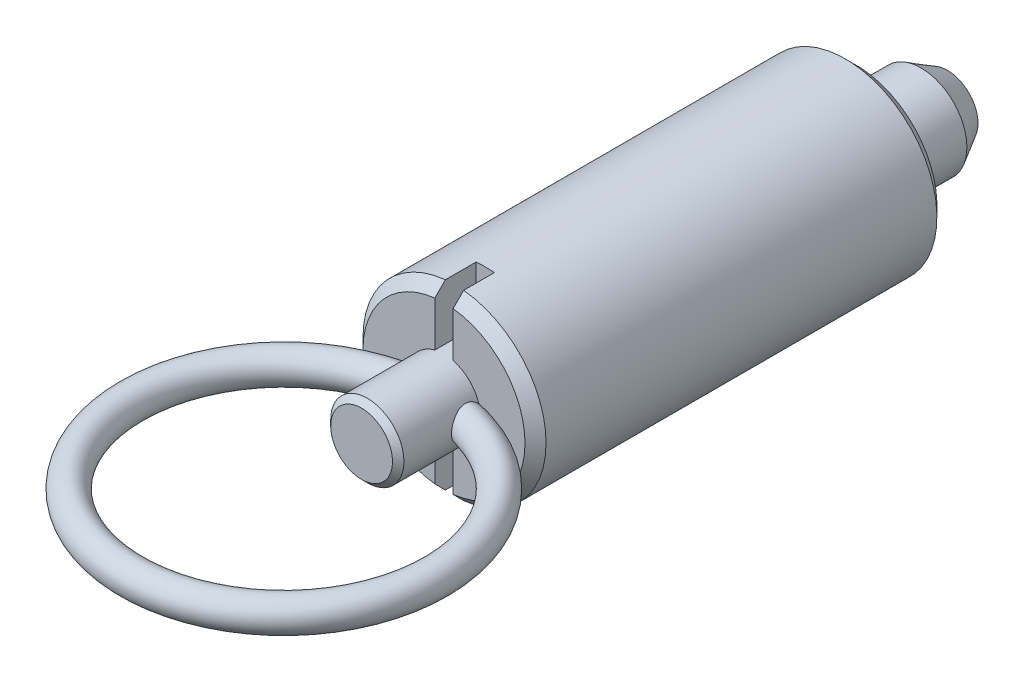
ISO-10303-21;
HEADER;
FILE_DESCRIPTION(('STEP AP214'),'2;1');
FILE_NAME('part.step','',(''),(''),'','','');
FILE_SCHEMA(('AUTOMOTIVE_DESIGN { 1 0 10303 214 1 1 1 1 }'));
ENDSEC;
DATA;
#1=APPLICATION_CONTEXT('core data for automotive mechanical design processes');
#2=APPLICATION_PROTOCOL_DEFINITION('international standard','automotive_design',2000,#1);
#3=PRODUCT_CONTEXT('',#1,'mechanical');
#4=PRODUCT('Part','Part','',(#3));
#5=PRODUCT_RELATED_PRODUCT_CATEGORY('part','',(#4));
#6=PRODUCT_DEFINITION_FORMATION('','',#4);
#7=PRODUCT_DEFINITION_CONTEXT('part definition',#1,'design');
#8=PRODUCT_DEFINITION('design','',#6,#7);
#9=PRODUCT_DEFINITION_SHAPE('','',#8);
#10=(LENGTH_UNIT() NAMED_UNIT(*) SI_UNIT(.MILLI.,.METRE.));
#11=(NAMED_UNIT(*) PLANE_ANGLE_UNIT() SI_UNIT($,.RADIAN.));
#12=(NAMED_UNIT(*) SI_UNIT($,.STERADIAN.) SOLID_ANGLE_UNIT());
#13=UNCERTAINTY_MEASURE_WITH_UNIT(LENGTH_MEASURE(1.E-05),#10,'distance_accuracy_value','');
#14=(GEOMETRIC_REPRESENTATION_CONTEXT(3) GLOBAL_UNCERTAINTY_ASSIGNED_CONTEXT((#13)) GLOBAL_UNIT_ASSIGNED_CONTEXT((#10,
#11,#12)) REPRESENTATION_CONTEXT('',''));
#15=CARTESIAN_POINT('',(0.,0.,0.));
#16=DIRECTION('',(0.,0.,1.));
#17=DIRECTION('',(1.,0.,0.));
#18=AXIS2_PLACEMENT_3D('',#15,#16,#17);
#19=CARTESIAN_POINT('',(2.67209438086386,0.,-8.));
#20=DIRECTION('',(0.,0.,1.));
#21=DIRECTION('',(0.,-1.,0.));
#22=AXIS2_PLACEMENT_3D('',#19,#20,#21);
#23=PLANE('',#22);
#24=CARTESIAN_POINT('',(0.,0.,-8.0000000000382));
#25=DIRECTION('',(0.,0.,1.));
#26=DIRECTION('',(0.,-1.,0.));
#27=AXIS2_PLACEMENT_3D('',#24,#25,#26);
#28=CIRCLE('',#27,2.67209438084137);
#29=CARTESIAN_POINT('',(0.,-2.67209438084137,-8.0000000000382));
#30=VERTEX_POINT('',#29);
#31=EDGE_CURVE('E211',#30,#30,#28,.T.);
#32=ORIENTED_EDGE('',*,*,#31,.F.);
#33=EDGE_LOOP('',(#32));
#34=FACE_BOUND('',#33,.T.);
#35=ADVANCED_FACE('F14',(#34),#23,.F.);
#36=CARTESIAN_POINT('',(0.,0.,-5.69999999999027));
#37=DIRECTION('',(0.,0.,1.));
#38=DIRECTION('',(0.,-1.,0.));
#39=AXIS2_PLACEMENT_3D('',#36,#37,#38);
#40=CONICAL_SURFACE('',#39,4.0000000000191,0.523598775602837);
#41=CARTESIAN_POINT('',(0.,0.,-5.7));
#42=DIRECTION('',(0.,0.,1.));
#43=DIRECTION('',(0.,-1.,0.));
#44=AXIS2_PLACEMENT_3D('',#41,#42,#43);
#45=CIRCLE('',#44,4.);
#46=CARTESIAN_POINT('',(0.,-4.,-5.7));
#47=VERTEX_POINT('',#46);
#48=EDGE_CURVE('E308',#47,#47,#45,.T.);
#49=ORIENTED_EDGE('',*,*,#48,.F.);
#50=EDGE_LOOP('',(#49));
#51=FACE_BOUND('',#50,.T.);
#52=ORIENTED_EDGE('',*,*,#31,.T.);
#53=EDGE_LOOP('',(#52));
#54=FACE_BOUND('',#53,.T.);
#55=ADVANCED_FACE('F189',(#51,#54),#40,.T.);
#56=CARTESIAN_POINT('',(0.,0.,-8.));
#57=DIRECTION('',(0.,0.,1.));
#58=DIRECTION('',(0.,-1.,0.));
#59=AXIS2_PLACEMENT_3D('',#56,#57,#58);
#60=CYLINDRICAL_SURFACE('',#59,4.);
#61=CARTESIAN_POINT('',(0.,0.,0.));
#62=DIRECTION('',(0.,0.,1.));
#63=DIRECTION('',(0.,-1.,0.));
#64=AXIS2_PLACEMENT_3D('',#61,#62,#63);
#65=CIRCLE('',#64,4.);
#66=CARTESIAN_POINT('',(0.,-4.,0.));
#67=VERTEX_POINT('',#66);
#68=EDGE_CURVE('E306',#67,#67,#65,.F.);
#69=ORIENTED_EDGE('',*,*,#68,.T.);
#70=EDGE_LOOP('',(#69));
#71=FACE_BOUND('',#70,.T.);
#72=ORIENTED_EDGE('',*,*,#48,.T.);
#73=EDGE_LOOP('',(#72));
#74=FACE_BOUND('',#73,.T.);
#75=ADVANCED_FACE('F185',(#71,#74),#60,.T.);
#76=CARTESIAN_POINT('',(7.08,0.,0.));
#77=DIRECTION('',(0.,0.,1.));
#78=DIRECTION('',(0.,-1.,0.));
#79=AXIS2_PLACEMENT_3D('',#76,#77,#78);
#80=PLANE('',#79);
#81=CARTESIAN_POINT('',(0.,0.,0.));
#82=DIRECTION('',(0.,0.,1.));
#83=DIRECTION('',(0.,-1.,0.));
#84=AXIS2_PLACEMENT_3D('',#81,#82,#83);
#85=CIRCLE('',#84,7.08);
#86=CARTESIAN_POINT('',(0.,-7.08,0.));
#87=VERTEX_POINT('',#86);
#88=EDGE_CURVE('E24',#87,#87,#85,.T.);
#89=ORIENTED_EDGE('',*,*,#88,.F.);
#90=EDGE_LOOP('',(#89));
#91=FACE_BOUND('',#90,.T.);
#92=ORIENTED_EDGE('',*,*,#68,.F.);
#93=EDGE_LOOP('',(#92));
#94=FACE_BOUND('',#93,.T.);
#95=ADVANCED_FACE('F178',(#91,#94),#80,.F.);
#96=CARTESIAN_POINT('',(0.,0.,0.92));
#97=DIRECTION('',(0.,0.,1.));
#98=DIRECTION('',(0.,-1.,0.));
#99=AXIS2_PLACEMENT_3D('',#96,#97,#98);
#100=CONICAL_SURFACE('',#99,8.,0.785398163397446);
#101=CARTESIAN_POINT('',(0.,0.,0.92));
#102=DIRECTION('',(0.,0.,1.));
#103=DIRECTION('',(0.,-1.,0.));
#104=AXIS2_PLACEMENT_3D('',#101,#102,#103);
#105=CIRCLE('',#104,8.);
#106=CARTESIAN_POINT('',(0.,-8.,0.92));
#107=VERTEX_POINT('',#106);
#108=EDGE_CURVE('E9',#107,#107,#105,.T.);
#109=ORIENTED_EDGE('',*,*,#108,.F.);
#110=EDGE_LOOP('',(#109));
#111=FACE_BOUND('',#110,.T.);
#112=ORIENTED_EDGE('',*,*,#88,.T.);
#113=EDGE_LOOP('',(#112));
#114=FACE_BOUND('',#113,.T.);
#115=ADVANCED_FACE('F169',(#111,#114),#100,.T.);
#116=CARTESIAN_POINT('',(0.,0.,-8.));
#117=DIRECTION('',(0.,0.,1.));
#118=DIRECTION('',(0.,-1.,0.));
#119=AXIS2_PLACEMENT_3D('',#116,#117,#118);
#120=CYLINDRICAL_SURFACE('',#119,8.);
#121=ORIENTED_EDGE('',*,*,#108,.T.);
#122=EDGE_LOOP('',(#121));
#123=FACE_BOUND('',#122,.T.);
#124=DIRECTION('',(0.,0.,1.));
#125=VECTOR('',#124,1.);
#126=CARTESIAN_POINT('',(-0.8,7.95989949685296,-8.));
#127=LINE('',#126,#125);
#128=CARTESIAN_POINT('',(-0.8,7.95989949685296,35.08));
#129=VERTEX_POINT('',#128);
#130=CARTESIAN_POINT('',(-0.8,7.95989949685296,32.4));
#131=VERTEX_POINT('',#130);
#132=EDGE_CURVE('E311',#129,#131,#127,.F.);
#133=ORIENTED_EDGE('',*,*,#132,.T.);
#134=CARTESIAN_POINT('',(0.,0.,32.4));
#135=DIRECTION('',(0.,0.,1.));
#136=DIRECTION('',(0.,-1.,0.));
#137=AXIS2_PLACEMENT_3D('',#134,#135,#136);
#138=CIRCLE('',#137,8.);
#139=CARTESIAN_POINT('',(0.8,7.95989949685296,32.4));
#140=VERTEX_POINT('',#139);
#141=EDGE_CURVE('E33',#140,#131,#138,.T.);
#142=ORIENTED_EDGE('',*,*,#141,.F.);
#143=DIRECTION('',(0.,0.,1.));
#144=VECTOR('',#143,1.);
#145=CARTESIAN_POINT('',(0.8,7.95989949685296,-8.));
#146=LINE('',#145,#144);
#147=CARTESIAN_POINT('',(0.8,7.95989949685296,35.08));
#148=VERTEX_POINT('',#147);
#149=EDGE_CURVE('E287',#140,#148,#146,.T.);
#150=ORIENTED_EDGE('',*,*,#149,.T.);
#151=CARTESIAN_POINT('',(0.,0.,35.08));
#152=DIRECTION('',(0.,0.,1.));
#153=DIRECTION('',(0.,-1.,0.));
#154=AXIS2_PLACEMENT_3D('',#151,#152,#153);
#155=CIRCLE('',#154,8.);
#156=CARTESIAN_POINT('',(0.8,-7.95989949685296,35.08));
#157=VERTEX_POINT('',#156);
#158=EDGE_CURVE('E284',#148,#157,#155,.F.);
#159=ORIENTED_EDGE('',*,*,#158,.T.);
#160=DIRECTION('',(0.,0.,1.));
#161=VECTOR('',#160,1.);
#162=CARTESIAN_POINT('',(0.8,-7.95989949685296,-8.));
#163=LINE('',#162,#161);
#164=CARTESIAN_POINT('',(0.8,-7.95989949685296,32.4));
#165=VERTEX_POINT('',#164);
#166=EDGE_CURVE('E281',#157,#165,#163,.F.);
#167=ORIENTED_EDGE('',*,*,#166,.T.);
#168=CARTESIAN_POINT('',(0.,0.,32.4));
#169=DIRECTION('',(0.,0.,1.));
#170=DIRECTION('',(0.,-1.,0.));
#171=AXIS2_PLACEMENT_3D('',#168,#169,#170);
#172=CIRCLE('',#171,8.);
#173=CARTESIAN_POINT('',(-0.8,-7.95989949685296,32.4));
#174=VERTEX_POINT('',#173);
#175=EDGE_CURVE('E95',#174,#165,#172,.T.);
#176=ORIENTED_EDGE('',*,*,#175,.F.);
#177=DIRECTION('',(0.,0.,1.));
#178=VECTOR('',#177,1.);
#179=CARTESIAN_POINT('',(-0.8,-7.95989949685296,-8.));
#180=LINE('',#179,#178);
#181=CARTESIAN_POINT('',(-0.8,-7.95989949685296,35.08));
#182=VERTEX_POINT('',#181);
#183=EDGE_CURVE('E279',#174,#182,#180,.T.);
#184=ORIENTED_EDGE('',*,*,#183,.T.);
#185=CARTESIAN_POINT('',(0.,0.,35.08));
#186=DIRECTION('',(0.,0.,1.));
#187=DIRECTION('',(0.,-1.,0.));
#188=AXIS2_PLACEMENT_3D('',#185,#186,#187);
#189=CIRCLE('',#188,8.);
#190=EDGE_CURVE('E316',#182,#129,#189,.F.);
#191=ORIENTED_EDGE('',*,*,#190,.T.);
#192=EDGE_LOOP('',(#133,#142,#150,#159,#167,#176,#184,#191));
#193=FACE_BOUND('',#192,.T.);
#194=ADVANCED_FACE('F167',(#123,#193),#120,.T.);
#195=CARTESIAN_POINT('',(0.,0.,43.2));
#196=DIRECTION('',(0.,0.,-1.));
#197=DIRECTION('',(0.,1.,0.));
#198=AXIS2_PLACEMENT_3D('',#195,#196,#197);
#199=PLANE('',#198);
#200=CARTESIAN_POINT('',(0.,0.,43.200000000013));
#201=DIRECTION('',(0.,0.,-1.));
#202=DIRECTION('',(0.,1.,0.));
#203=AXIS2_PLACEMENT_3D('',#200,#201,#202);
#204=CIRCLE('',#203,2.70000000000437);
#205=CARTESIAN_POINT('',(0.,2.70000000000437,43.200000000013));
#206=VERTEX_POINT('',#205);
#207=EDGE_CURVE('E18',#206,#206,#204,.T.);
#208=ORIENTED_EDGE('',*,*,#207,.F.);
#209=EDGE_LOOP('',(#208));
#210=FACE_BOUND('',#209,.T.);
#211=ADVANCED_FACE('F16',(#210),#199,.F.);
#212=CARTESIAN_POINT('',(0.,0.,42.7000000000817));
#213=DIRECTION('',(0.,0.,-1.));
#214=DIRECTION('',(0.,1.,0.));
#215=AXIS2_PLACEMENT_3D('',#212,#213,#214);
#216=CONICAL_SURFACE('',#215,3.1999999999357,0.785398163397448);
#217=ORIENTED_EDGE('',*,*,#207,.T.);
#218=EDGE_LOOP('',(#217));
#219=FACE_BOUND('',#218,.T.);
#220=CARTESIAN_POINT('',(0.,0.,42.7));
#221=DIRECTION('',(0.,0.,1.));
#222=DIRECTION('',(0.,-1.,0.));
#223=AXIS2_PLACEMENT_3D('',#220,#221,#222);
#224=CIRCLE('',#223,3.2);
#225=CARTESIAN_POINT('',(0.,-3.2,42.7));
#226=VERTEX_POINT('',#225);
#227=EDGE_CURVE('E261',#226,#226,#224,.F.);
#228=ORIENTED_EDGE('',*,*,#227,.F.);
#229=EDGE_LOOP('',(#228));
#230=FACE_BOUND('',#229,.T.);
#231=ADVANCED_FACE('F158',(#219,#230),#216,.T.);
#232=CARTESIAN_POINT('',(0.,0.,50.));
#233=DIRECTION('',(0.,-1.,0.));
#234=DIRECTION('',(1.,0.,0.));
#235=AXIS2_PLACEMENT_3D('',#232,#233,#234);
#236=TOROIDAL_SURFACE('',#235,13.3,1.4);
#237=CARTESIAN_POINT('',(3.05618725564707,-0.948535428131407,36.));
#238=CARTESIAN_POINT('',(3.04759612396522,-0.976219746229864,36.0242287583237));
#239=CARTESIAN_POINT('',(3.03891006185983,-1.00287333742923,36.0495771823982));
#240=CARTESIAN_POINT('',(3.02156498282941,-1.05397916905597,36.1024245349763));
#241=CARTESIAN_POINT('',(3.01290597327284,-1.07843085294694,36.1299240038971));
#242=CARTESIAN_POINT('',(2.98728700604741,-1.14829294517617,36.215545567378));
#243=CARTESIAN_POINT('',(2.97070065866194,-1.19016221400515,36.2767487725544));
#244=CARTESIAN_POINT('',(2.94038479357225,-1.26321685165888,36.4060573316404));
#245=CARTESIAN_POINT('',(2.92666198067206,-1.29437725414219,36.4741783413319));
#246=CARTESIAN_POINT('',(2.90378062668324,-1.34492927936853,36.615278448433));
#247=CARTESIAN_POINT('',(2.89461472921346,-1.36433988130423,36.688249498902));
#248=CARTESIAN_POINT('',(2.88214674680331,-1.39047901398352,36.8336037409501));
#249=CARTESIAN_POINT('',(2.87860779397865,-1.39772061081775,36.9058754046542));
#250=CARTESIAN_POINT('',(2.87683702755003,-1.40136047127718,37.050776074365));
#251=CARTESIAN_POINT('',(2.87860876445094,-1.39775148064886,37.1234052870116));
#252=CARTESIAN_POINT('',(2.8870631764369,-1.38020225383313,37.2683154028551));
#253=CARTESIAN_POINT('',(2.89382782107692,-1.36608954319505,37.3405699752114));
#254=CARTESIAN_POINT('',(2.91139074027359,-1.32824478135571,37.481970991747));
#255=CARTESIAN_POINT('',(2.92219002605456,-1.3045103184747,37.5511166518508));
#256=CARTESIAN_POINT('',(2.94831498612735,-1.24444788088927,37.6942866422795));
#257=CARTESIAN_POINT('',(2.96405578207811,-1.20684897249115,37.7677018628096));
#258=CARTESIAN_POINT('',(2.99748458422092,-1.12124820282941,37.907807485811));
#259=CARTESIAN_POINT('',(3.01517509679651,-1.07323287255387,37.9744890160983));
#260=CARTESIAN_POINT('',(3.05284177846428,-0.961273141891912,38.1069865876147));
#261=CARTESIAN_POINT('',(3.07284279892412,-0.896121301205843,38.1717849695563));
#262=CARTESIAN_POINT('',(3.11061394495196,-0.75459454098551,38.2884758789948));
#263=CARTESIAN_POINT('',(3.12838786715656,-0.678239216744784,38.3403905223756));
#264=CARTESIAN_POINT('',(3.15513153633,-0.537433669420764,38.4164101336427));
#265=CARTESIAN_POINT('',(3.16518608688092,-0.475196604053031,38.4442390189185));
#266=CARTESIAN_POINT('',(3.18182284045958,-0.34667790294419,38.4897350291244));
#267=CARTESIAN_POINT('',(3.18840858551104,-0.280400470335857,38.507412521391));
#268=CARTESIAN_POINT('',(3.19742480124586,-0.145195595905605,38.5315158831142));
#269=CARTESIAN_POINT('',(3.19983533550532,-0.0762570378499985,38.5378877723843));
#270=CARTESIAN_POINT('',(3.20014812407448,0.061706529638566,38.5387178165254));
#271=CARTESIAN_POINT('',(3.1980505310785,0.130731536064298,38.5331763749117));
#272=CARTESIAN_POINT('',(3.18991907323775,0.26152850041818,38.5114592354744));
#273=CARTESIAN_POINT('',(3.18418816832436,0.32345907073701,38.4961013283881));
#274=CARTESIAN_POINT('',(3.16963143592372,0.443988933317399,38.4564583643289));
#275=CARTESIAN_POINT('',(3.16080479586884,0.502587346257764,38.4321709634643));
#276=CARTESIAN_POINT('',(3.14003309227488,0.619669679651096,38.3736885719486));
#277=CARTESIAN_POINT('',(3.12790385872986,0.677815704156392,38.3388873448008));
#278=CARTESIAN_POINT('',(3.10188585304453,0.788376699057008,38.2616450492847));
#279=CARTESIAN_POINT('',(3.0879953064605,0.840785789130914,38.2191962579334));
#280=CARTESIAN_POINT('',(3.05685037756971,0.948336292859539,38.1195710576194));
#281=CARTESIAN_POINT('',(3.03944244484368,1.00225298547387,38.0611197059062));
#282=CARTESIAN_POINT('',(3.00512012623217,1.10090258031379,37.9367365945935));
#283=CARTESIAN_POINT('',(2.98820627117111,1.14562589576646,37.8707971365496));
#284=CARTESIAN_POINT('',(2.95418482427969,1.23093169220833,37.722775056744));
#285=CARTESIAN_POINT('',(2.937399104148,1.2699939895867,37.6397345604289));
#286=CARTESIAN_POINT('',(2.90900263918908,1.33376994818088,37.4673634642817));
#287=CARTESIAN_POINT('',(2.89739038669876,1.35848779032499,37.3780347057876));
#288=CARTESIAN_POINT('',(2.88568690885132,1.38306855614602,37.2434882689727));
#289=CARTESIAN_POINT('',(2.88274591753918,1.38917044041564,37.1995899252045));
#290=CARTESIAN_POINT('',(2.8787133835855,1.39750979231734,37.1113524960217));
#291=CARTESIAN_POINT('',(2.87762076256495,1.3997495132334,37.0670136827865));
#292=CARTESIAN_POINT('',(2.87739660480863,1.40021032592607,36.9783688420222));
#293=CARTESIAN_POINT('',(2.87826226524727,1.39843716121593,36.9340628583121));
#294=CARTESIAN_POINT('',(2.88196110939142,1.39079690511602,36.8459048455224));
#295=CARTESIAN_POINT('',(2.88479395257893,1.38493052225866,36.8020527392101));
#296=CARTESIAN_POINT('',(2.89498816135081,1.36355411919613,36.6851446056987));
#297=CARTESIAN_POINT('',(2.9041271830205,1.34417873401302,36.6129028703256));
#298=CARTESIAN_POINT('',(2.92685394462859,1.29393784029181,36.4732402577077));
#299=CARTESIAN_POINT('',(2.94044735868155,1.26305766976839,36.4058256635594));
#300=CARTESIAN_POINT('',(2.97061524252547,1.19037642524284,36.2770777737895));
#301=CARTESIAN_POINT('',(2.98721441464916,1.14848344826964,36.2158019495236));
#302=CARTESIAN_POINT('',(3.01285726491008,1.07856738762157,36.1300799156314));
#303=CARTESIAN_POINT('',(3.02152587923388,1.05409195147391,36.1025460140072));
#304=CARTESIAN_POINT('',(3.03889047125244,1.00293348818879,36.0496345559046));
#305=CARTESIAN_POINT('',(3.0475864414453,0.976251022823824,36.0242564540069));
#306=CARTESIAN_POINT('',(3.05618725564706,0.948535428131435,36.));
#307=B_SPLINE_CURVE_WITH_KNOTS('',3,(#237,#238,#239,#240,#241,#242,#243,#244,#245,#246,#247,
#248,#249,#250,#251,#252,#253,#254,#255,#256,#257,#258,#259,#260,#261,#262,#263,#264,#265,#266,
#267,#268,#269,#270,#271,#272,#273,#274,#275,#276,#277,#278,#279,#280,#281,#282,#283,#284,#285,
#286,#287,#288,#289,#290,#291,#292,#293,#294,#295,#296,#297,#298,#299,#300,#301,#302,#303,#304,
#305,#306),.UNSPECIFIED.,.F.,.F.,(4,2,2,2,2,2,2,2,2,2,2,2,2,2,2,2,2,2,2,2,2,2,2,2,2,2,2,2,2,2,2,
2,2,2,4),(0.,0.113273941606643,0.226576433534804,0.453376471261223,0.680701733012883,
0.907658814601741,1.1247819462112,1.34205026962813,1.56296717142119,1.78393948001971,
2.03486370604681,2.28611434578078,2.56681608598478,2.84703259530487,3.05293332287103,
3.25862339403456,3.46529294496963,3.67195549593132,3.86331580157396,4.05472637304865,
4.26048613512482,4.46645486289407,4.7097330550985,4.95326366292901,5.23181287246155,
5.51028085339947,5.64336214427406,5.77636576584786,5.90917914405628,6.04196953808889,
6.26675287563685,6.49182366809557,6.71883585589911,6.83226624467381,6.94566784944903),.UNSPECIFIED.);
#308=CARTESIAN_POINT('',(3.05618725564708,-0.948535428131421,36.));
#309=VERTEX_POINT('',#308);
#310=CARTESIAN_POINT('',(3.05618725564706,0.948535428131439,36.));
#311=VERTEX_POINT('',#310);
#312=EDGE_CURVE('E93',#309,#311,#307,.T.);
#313=ORIENTED_EDGE('',*,*,#312,.F.);
#314=CARTESIAN_POINT('',(3.05618725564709,-0.948535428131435,36.));
#315=CARTESIAN_POINT('',(3.11757531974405,-0.934303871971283,36.));
#316=CARTESIAN_POINT('',(3.1787658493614,-0.919154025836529,36.));
#317=CARTESIAN_POINT('',(3.30064120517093,-0.886604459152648,36.));
#318=CARTESIAN_POINT('',(3.36132513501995,-0.869201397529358,36.));
#319=CARTESIAN_POINT('',(3.48280168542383,-0.831489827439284,36.));
#320=CARTESIAN_POINT('',(3.54358210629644,-0.811141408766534,35.9999999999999));
#321=CARTESIAN_POINT('',(3.66391929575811,-0.767183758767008,36.0000000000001));
#322=CARTESIAN_POINT('',(3.72347671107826,-0.743576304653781,36.0000000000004));
#323=CARTESIAN_POINT('',(3.84948729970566,-0.688571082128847,36.0000000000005));
#324=CARTESIAN_POINT('',(3.91567340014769,-0.6565387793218,36.0000000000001));
#325=CARTESIAN_POINT('',(4.01198947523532,-0.603316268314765,36.));
#326=CARTESIAN_POINT('',(4.04356327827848,-0.584739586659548,36.));
#327=CARTESIAN_POINT('',(4.10542236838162,-0.545563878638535,36.));
#328=CARTESIAN_POINT('',(4.13570822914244,-0.524965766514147,36.));
#329=CARTESIAN_POINT('',(4.20107407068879,-0.476575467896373,36.));
#330=CARTESIAN_POINT('',(4.23572982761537,-0.448200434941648,36.));
#331=CARTESIAN_POINT('',(4.30114070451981,-0.387170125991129,36.));
#332=CARTESIAN_POINT('',(4.33189858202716,-0.354517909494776,36.));
#333=CARTESIAN_POINT('',(4.37886544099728,-0.294918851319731,36.));
#334=CARTESIAN_POINT('',(4.39666034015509,-0.269236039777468,36.));
#335=CARTESIAN_POINT('',(4.42807946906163,-0.215481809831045,36.));
#336=CARTESIAN_POINT('',(4.44171797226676,-0.187418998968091,36.));
#337=CARTESIAN_POINT('',(4.46148654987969,-0.134775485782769,36.));
#338=CARTESIAN_POINT('',(4.46855216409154,-0.110550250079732,36.));
#339=CARTESIAN_POINT('',(4.47850333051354,-0.061256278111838,36.));
#340=CARTESIAN_POINT('',(4.48139284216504,-0.0361883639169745,36.));
#341=CARTESIAN_POINT('',(4.48269592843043,0.0141225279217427,36.));
#342=CARTESIAN_POINT('',(4.48109955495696,0.0393657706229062,36.));
#343=CARTESIAN_POINT('',(4.47358395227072,0.0892015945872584,36.));
#344=CARTESIAN_POINT('',(4.46766114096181,0.113793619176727,36.));
#345=CARTESIAN_POINT('',(4.45018950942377,0.167425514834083,36.));
#346=CARTESIAN_POINT('',(4.43763875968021,0.196135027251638,36.));
#347=CARTESIAN_POINT('',(4.40807259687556,0.25119605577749,36.));
#348=CARTESIAN_POINT('',(4.39104303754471,0.27753973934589,36.));
#349=CARTESIAN_POINT('',(4.35747735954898,0.322732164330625,36.));
#350=CARTESIAN_POINT('',(4.3415256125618,0.342025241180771,36.));
#351=CARTESIAN_POINT('',(4.30803028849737,0.379112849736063,36.));
#352=CARTESIAN_POINT('',(4.29048901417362,0.396909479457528,36.));
#353=CARTESIAN_POINT('',(4.23589297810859,0.448390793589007,36.));
#354=CARTESIAN_POINT('',(4.19694549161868,0.480066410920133,36.));
#355=CARTESIAN_POINT('',(4.11494332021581,0.539787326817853,36.));
#356=CARTESIAN_POINT('',(4.07180962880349,0.567720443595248,36.));
#357=CARTESIAN_POINT('',(3.98335508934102,0.619930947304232,36.));
#358=CARTESIAN_POINT('',(3.93803224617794,0.644204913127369,36.));
#359=CARTESIAN_POINT('',(3.84575758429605,0.68981589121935,36.));
#360=CARTESIAN_POINT('',(3.79880068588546,0.711142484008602,36.));
#361=CARTESIAN_POINT('',(3.70382084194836,0.751278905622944,36.));
#362=CARTESIAN_POINT('',(3.65579766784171,0.770088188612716,36.));
#363=CARTESIAN_POINT('',(3.56213969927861,0.804416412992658,36.));
#364=CARTESIAN_POINT('',(3.51655381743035,0.820070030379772,36.));
#365=CARTESIAN_POINT('',(3.42485591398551,0.8497685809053,36.));
#366=CARTESIAN_POINT('',(3.37874381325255,0.863813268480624,36.));
#367=CARTESIAN_POINT('',(3.2867198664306,0.890321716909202,36.));
#368=CARTESIAN_POINT('',(3.24081322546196,0.902803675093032,36.));
#369=CARTESIAN_POINT('',(3.1487061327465,0.926545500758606,36.));
#370=CARTESIAN_POINT('',(3.10250582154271,0.937805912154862,36.));
#371=CARTESIAN_POINT('',(3.05618725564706,0.948535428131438,36.));
#372=B_SPLINE_CURVE_WITH_KNOTS('',3,(#314,#315,#316,#317,#318,#319,#320,#321,#322,#323,#324,
#325,#326,#327,#328,#329,#330,#331,#332,#333,#334,#335,#336,#337,#338,#339,#340,#341,#342,#343,
#344,#345,#346,#347,#348,#349,#350,#351,#352,#353,#354,#355,#356,#357,#358,#359,#360,#361,#362,
#363,#364,#365,#366,#367,#368,#369,#370,#371),.UNSPECIFIED.,.F.,.F.,(4,2,2,2,2,2,2,2,2,2,2,2,2,
2,2,2,2,2,2,2,2,2,2,2,2,2,2,2,4),(0.,0.189063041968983,0.378409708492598,0.570615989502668,
0.762717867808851,0.982945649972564,1.0927846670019,1.20257423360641,1.33668510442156,
1.47070056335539,1.56415704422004,1.65728887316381,1.73267389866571,1.80798740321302,
1.88346805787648,1.95901127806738,2.05249160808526,2.1462708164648,2.22126633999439,
2.29615490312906,2.44631220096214,2.60027018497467,2.75437123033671,2.9090038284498,
3.06366990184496,3.20823235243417,3.35281683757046,3.4955194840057,3.63815832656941),.UNSPECIFIED.);
#373=EDGE_CURVE('E87',#309,#311,#372,.T.);
#374=ORIENTED_EDGE('',*,*,#373,.T.);
#375=EDGE_LOOP('',(#313,#374));
#376=FACE_BOUND('',#375,.T.);
#377=CARTESIAN_POINT('',(-3.05618725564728,0.948535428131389,36.));
#378=CARTESIAN_POINT('',(-3.11757531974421,0.93430387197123,36.));
#379=CARTESIAN_POINT('',(-3.17876584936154,0.919154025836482,36.));
#380=CARTESIAN_POINT('',(-3.30064120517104,0.886604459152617,36.));
#381=CARTESIAN_POINT('',(-3.36132513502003,0.869201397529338,36.));
#382=CARTESIAN_POINT('',(-3.48280168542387,0.831489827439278,36.));
#383=CARTESIAN_POINT('',(-3.54358210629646,0.81114140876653,35.9999999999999));
#384=CARTESIAN_POINT('',(-3.66391929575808,0.767183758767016,36.0000000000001));
#385=CARTESIAN_POINT('',(-3.72347671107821,0.743576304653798,36.0000000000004));
#386=CARTESIAN_POINT('',(-3.84948729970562,0.688571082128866,36.0000000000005));
#387=CARTESIAN_POINT('',(-3.91567340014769,0.65653877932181,36.0000000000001));
#388=CARTESIAN_POINT('',(-4.01198947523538,0.603316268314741,36.));
#389=CARTESIAN_POINT('',(-4.04356327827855,0.584739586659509,36.));
#390=CARTESIAN_POINT('',(-4.10542236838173,0.545563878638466,36.));
#391=CARTESIAN_POINT('',(-4.13570822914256,0.524965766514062,36.));
#392=CARTESIAN_POINT('',(-4.20107407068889,0.47657546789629,36.));
#393=CARTESIAN_POINT('',(-4.23572982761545,0.448200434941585,36.));
#394=CARTESIAN_POINT('',(-4.30114070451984,0.387170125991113,36.));
#395=CARTESIAN_POINT('',(-4.33189858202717,0.354517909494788,36.));
#396=CARTESIAN_POINT('',(-4.37886544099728,0.294918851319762,36.));
#397=CARTESIAN_POINT('',(-4.39666034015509,0.269236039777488,36.));
#398=CARTESIAN_POINT('',(-4.42807946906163,0.215481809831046,36.));
#399=CARTESIAN_POINT('',(-4.44171797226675,0.187418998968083,36.));
#400=CARTESIAN_POINT('',(-4.46148654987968,0.134775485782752,36.));
#401=CARTESIAN_POINT('',(-4.46855216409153,0.110550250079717,36.));
#402=CARTESIAN_POINT('',(-4.47850333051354,0.061256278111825,36.));
#403=CARTESIAN_POINT('',(-4.48139284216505,0.0361883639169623,36.));
#404=CARTESIAN_POINT('',(-4.48269592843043,-0.0141225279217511,36.));
#405=CARTESIAN_POINT('',(-4.48109955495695,-0.0393657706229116,36.));
#406=CARTESIAN_POINT('',(-4.47358395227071,-0.089201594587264,36.));
#407=CARTESIAN_POINT('',(-4.46766114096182,-0.113793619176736,36.));
#408=CARTESIAN_POINT('',(-4.45018950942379,-0.167425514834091,36.));
#409=CARTESIAN_POINT('',(-4.43763875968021,-0.196135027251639,36.));
#410=CARTESIAN_POINT('',(-4.40807259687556,-0.251196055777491,36.));
#411=CARTESIAN_POINT('',(-4.39104303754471,-0.277539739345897,36.));
#412=CARTESIAN_POINT('',(-4.35747735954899,-0.322732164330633,36.));
#413=CARTESIAN_POINT('',(-4.3415256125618,-0.342025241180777,36.));
#414=CARTESIAN_POINT('',(-4.30803028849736,-0.379112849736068,36.));
#415=CARTESIAN_POINT('',(-4.29048901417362,-0.396909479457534,36.));
#416=CARTESIAN_POINT('',(-4.23589297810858,-0.448390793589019,36.));
#417=CARTESIAN_POINT('',(-4.19694549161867,-0.480066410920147,36.));
#418=CARTESIAN_POINT('',(-4.1149433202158,-0.539787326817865,36.));
#419=CARTESIAN_POINT('',(-4.07180962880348,-0.567720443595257,36.));
#420=CARTESIAN_POINT('',(-3.98335508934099,-0.619930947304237,36.));
#421=CARTESIAN_POINT('',(-3.93803224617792,-0.644204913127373,36.));
#422=CARTESIAN_POINT('',(-3.84575758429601,-0.689815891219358,36.));
#423=CARTESIAN_POINT('',(-3.79880068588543,-0.711142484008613,36.));
#424=CARTESIAN_POINT('',(-3.70382084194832,-0.751278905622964,36.));
#425=CARTESIAN_POINT('',(-3.65579766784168,-0.770088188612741,36.));
#426=CARTESIAN_POINT('',(-3.56213969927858,-0.804416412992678,36.));
#427=CARTESIAN_POINT('',(-3.51655381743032,-0.820070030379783,36.));
#428=CARTESIAN_POINT('',(-3.42485591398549,-0.849768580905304,36.));
#429=CARTESIAN_POINT('',(-3.37874381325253,-0.863813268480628,36.));
#430=CARTESIAN_POINT('',(-3.28671986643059,-0.890321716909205,36.));
#431=CARTESIAN_POINT('',(-3.24081322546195,-0.902803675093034,36.));
#432=CARTESIAN_POINT('',(-3.1487061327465,-0.926545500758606,36.));
#433=CARTESIAN_POINT('',(-3.10250582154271,-0.937805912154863,36.));
#434=CARTESIAN_POINT('',(-3.05618725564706,-0.948535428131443,36.));
#435=B_SPLINE_CURVE_WITH_KNOTS('',3,(#377,#378,#379,#380,#381,#382,#383,#384,#385,#386,#387,
#388,#389,#390,#391,#392,#393,#394,#395,#396,#397,#398,#399,#400,#401,#402,#403,#404,#405,#406,
#407,#408,#409,#410,#411,#412,#413,#414,#415,#416,#417,#418,#419,#420,#421,#422,#423,#424,#425,
#426,#427,#428,#429,#430,#431,#432,#433,#434),.UNSPECIFIED.,.F.,.F.,(4,2,2,2,2,2,2,2,2,2,2,2,2,
2,2,2,2,2,2,2,2,2,2,2,2,2,2,2,4),(0.,0.189063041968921,0.378409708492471,0.570615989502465,
0.762717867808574,0.982945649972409,1.09278466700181,1.20257423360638,1.33668510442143,
1.47070056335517,1.56415704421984,1.65728887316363,1.73267389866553,1.80798740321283,
1.88346805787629,1.95901127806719,2.05249160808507,2.14627081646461,2.22126633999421,
2.29615490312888,2.44631220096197,2.6002701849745,2.75437123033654,2.90900382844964,
3.06366990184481,3.20823235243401,3.35281683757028,3.49551948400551,3.63815832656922),.UNSPECIFIED.);
#436=CARTESIAN_POINT('',(-3.05618725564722,0.94853542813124,36.));
#437=VERTEX_POINT('',#436);
#438=CARTESIAN_POINT('',(-3.05618725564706,-0.948535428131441,36.));
#439=VERTEX_POINT('',#438);
#440=EDGE_CURVE('E111',#437,#439,#435,.T.);
#441=ORIENTED_EDGE('',*,*,#440,.T.);
#442=CARTESIAN_POINT('',(-3.05618725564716,0.948535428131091,36.));
#443=CARTESIAN_POINT('',(-3.04759612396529,0.976219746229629,36.0242287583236));
#444=CARTESIAN_POINT('',(-3.03891006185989,1.00287333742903,36.049577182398));
#445=CARTESIAN_POINT('',(-3.02156498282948,1.05397916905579,36.1024245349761));
#446=CARTESIAN_POINT('',(-3.01290597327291,1.07843085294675,36.1299240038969));
#447=CARTESIAN_POINT('',(-2.98728700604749,1.14829294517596,36.2155455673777));
#448=CARTESIAN_POINT('',(-2.97070065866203,1.19016221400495,36.2767487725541));
#449=CARTESIAN_POINT('',(-2.94038479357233,1.26321685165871,36.40605733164));
#450=CARTESIAN_POINT('',(-2.92666198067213,1.29437725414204,36.4741783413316));
#451=CARTESIAN_POINT('',(-2.90378062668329,1.34492927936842,36.6152784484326));
#452=CARTESIAN_POINT('',(-2.8946147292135,1.36433988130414,36.6882494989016));
#453=CARTESIAN_POINT('',(-2.88214674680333,1.39047901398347,36.8336037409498));
#454=CARTESIAN_POINT('',(-2.87860779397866,1.39772061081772,36.9058754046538));
#455=CARTESIAN_POINT('',(-2.87683702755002,1.40136047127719,37.0507760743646));
#456=CARTESIAN_POINT('',(-2.87860876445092,1.39775148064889,37.1234052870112));
#457=CARTESIAN_POINT('',(-2.88706317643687,1.38020225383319,37.2683154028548));
#458=CARTESIAN_POINT('',(-2.89382782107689,1.36608954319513,37.3405699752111));
#459=CARTESIAN_POINT('',(-2.91139074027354,1.32824478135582,37.4819709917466));
#460=CARTESIAN_POINT('',(-2.92219002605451,1.30451031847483,37.5511166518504));
#461=CARTESIAN_POINT('',(-2.94831498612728,1.24444788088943,37.6942866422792));
#462=CARTESIAN_POINT('',(-2.96405578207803,1.20684897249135,37.7677018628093));
#463=CARTESIAN_POINT('',(-2.99748458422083,1.12124820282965,37.9078074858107));
#464=CARTESIAN_POINT('',(-3.01517509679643,1.07323287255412,37.9744890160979));
#465=CARTESIAN_POINT('',(-3.05284177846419,0.96127314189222,38.1069865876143));
#466=CARTESIAN_POINT('',(-3.07284279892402,0.89612130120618,38.171784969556));
#467=CARTESIAN_POINT('',(-3.11061394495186,0.75459454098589,38.2884758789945));
#468=CARTESIAN_POINT('',(-3.12838786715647,0.678239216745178,38.3403905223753));
#469=CARTESIAN_POINT('',(-3.15513153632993,0.537433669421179,38.4164101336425));
#470=CARTESIAN_POINT('',(-3.16518608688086,0.475196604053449,38.4442390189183));
#471=CARTESIAN_POINT('',(-3.18182284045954,0.346677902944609,38.4897350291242));
#472=CARTESIAN_POINT('',(-3.188408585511,0.280400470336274,38.5074125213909));
#473=CARTESIAN_POINT('',(-3.19742480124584,0.145195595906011,38.5315158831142));
#474=CARTESIAN_POINT('',(-3.19983533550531,0.0762570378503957,38.5378877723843));
#475=CARTESIAN_POINT('',(-3.20014812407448,-0.0617065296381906,38.5387178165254));
#476=CARTESIAN_POINT('',(-3.19805053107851,-0.130731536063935,38.5331763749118));
#477=CARTESIAN_POINT('',(-3.18991907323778,-0.261528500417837,38.5114592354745));
#478=CARTESIAN_POINT('',(-3.18418816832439,-0.323459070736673,38.4961013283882));
#479=CARTESIAN_POINT('',(-3.16963143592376,-0.443988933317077,38.456458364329));
#480=CARTESIAN_POINT('',(-3.16080479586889,-0.502587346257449,38.4321709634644));
#481=CARTESIAN_POINT('',(-3.14003309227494,-0.619669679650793,38.3736885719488));
#482=CARTESIAN_POINT('',(-3.12790385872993,-0.677815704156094,38.338887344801));
#483=CARTESIAN_POINT('',(-3.10188585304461,-0.788376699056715,38.2616450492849));
#484=CARTESIAN_POINT('',(-3.08799530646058,-0.840785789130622,38.2191962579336));
#485=CARTESIAN_POINT('',(-3.0568503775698,-0.948336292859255,38.1195710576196));
#486=CARTESIAN_POINT('',(-3.03944244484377,-1.0022529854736,38.0611197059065));
#487=CARTESIAN_POINT('',(-3.00512012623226,-1.10090258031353,37.9367365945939));
#488=CARTESIAN_POINT('',(-2.98820627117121,-1.14562589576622,37.87079713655));
#489=CARTESIAN_POINT('',(-2.95418482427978,-1.23093169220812,37.7227750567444));
#490=CARTESIAN_POINT('',(-2.93739910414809,-1.2699939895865,37.6397345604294));
#491=CARTESIAN_POINT('',(-2.90900263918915,-1.33376994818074,37.4673634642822));
#492=CARTESIAN_POINT('',(-2.89739038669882,-1.35848779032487,37.3780347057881));
#493=CARTESIAN_POINT('',(-2.88568690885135,-1.38306855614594,37.2434882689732));
#494=CARTESIAN_POINT('',(-2.88274591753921,-1.38917044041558,37.199589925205));
#495=CARTESIAN_POINT('',(-2.87871338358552,-1.39750979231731,37.1113524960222));
#496=CARTESIAN_POINT('',(-2.87762076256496,-1.39974951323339,37.067013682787));
#497=CARTESIAN_POINT('',(-2.87739660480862,-1.40021032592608,36.9783688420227));
#498=CARTESIAN_POINT('',(-2.87826226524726,-1.39843716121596,36.9340628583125));
#499=CARTESIAN_POINT('',(-2.88196110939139,-1.39079690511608,36.8459048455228));
#500=CARTESIAN_POINT('',(-2.8847939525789,-1.38493052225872,36.8020527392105));
#501=CARTESIAN_POINT('',(-2.89498816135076,-1.36355411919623,36.6851446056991));
#502=CARTESIAN_POINT('',(-2.90412718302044,-1.34417873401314,36.612902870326));
#503=CARTESIAN_POINT('',(-2.92685394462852,-1.29393784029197,36.4732402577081));
#504=CARTESIAN_POINT('',(-2.94044735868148,-1.26305766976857,36.4058256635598));
#505=CARTESIAN_POINT('',(-2.9706152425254,-1.19037642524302,36.2770777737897));
#506=CARTESIAN_POINT('',(-2.9872144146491,-1.14848344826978,36.2158019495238));
#507=CARTESIAN_POINT('',(-3.01285726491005,-1.07856738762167,36.1300799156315));
#508=CARTESIAN_POINT('',(-3.02152587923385,-1.05409195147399,36.1025460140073));
#509=CARTESIAN_POINT('',(-3.03889047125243,-1.00293348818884,36.0496345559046));
#510=CARTESIAN_POINT('',(-3.04758644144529,-0.976251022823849,36.0242564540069));
#511=CARTESIAN_POINT('',(-3.05618725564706,-0.948535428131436,36.));
#512=B_SPLINE_CURVE_WITH_KNOTS('',3,(#442,#443,#444,#445,#446,#447,#448,#449,#450,#451,#452,
#453,#454,#455,#456,#457,#458,#459,#460,#461,#462,#463,#464,#465,#466,#467,#468,#469,#470,#471,
#472,#473,#474,#475,#476,#477,#478,#479,#480,#481,#482,#483,#484,#485,#486,#487,#488,#489,#490,
#491,#492,#493,#494,#495,#496,#497,#498,#499,#500,#501,#502,#503,#504,#505,#506,#507,#508,#509,
#510,#511),.UNSPECIFIED.,.F.,.F.,(4,2,2,2,2,2,2,2,2,2,2,2,2,2,2,2,2,2,2,2,2,2,2,2,2,2,2,2,2,2,2,
2,2,2,4),(0.,0.113273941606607,0.226576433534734,0.453376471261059,0.680701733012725,
0.907658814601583,1.12478194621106,1.34205026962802,1.56296717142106,1.78393948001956,
2.03486370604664,2.28611434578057,2.56681608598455,2.84703259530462,3.05293332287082,
3.25862339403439,3.46529294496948,3.67195549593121,3.86331580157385,4.05472637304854,
4.2604861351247,4.46645486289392,4.7097330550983,4.95326366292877,5.23181287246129,
5.5102808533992,5.6433621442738,5.77636576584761,5.90917914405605,6.04196953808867,
6.26675287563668,6.49182366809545,6.71883585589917,6.83226624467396,6.94566784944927),.UNSPECIFIED.);
#513=EDGE_CURVE('E135',#437,#439,#512,.T.);
#514=ORIENTED_EDGE('',*,*,#513,.F.);
#515=EDGE_LOOP('',(#441,#514));
#516=FACE_BOUND('',#515,.T.);
#517=ADVANCED_FACE('F90',(#376,#516),#236,.T.);
#518=CARTESIAN_POINT('',(0.,0.,36.));
#519=DIRECTION('',(0.,0.,-1.));
#520=DIRECTION('',(0.,1.,0.));
#521=AXIS2_PLACEMENT_3D('',#518,#519,#520);
#522=PLANE('',#521);
#523=ORIENTED_EDGE('',*,*,#373,.F.);
#524=CARTESIAN_POINT('',(0.,0.,36.));
#525=DIRECTION('',(0.,0.,1.));
#526=DIRECTION('',(0.,-1.,0.));
#527=AXIS2_PLACEMENT_3D('',#524,#525,#526);
#528=CIRCLE('',#527,3.2);
#529=CARTESIAN_POINT('',(0.8,-3.09838667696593,36.));
#530=VERTEX_POINT('',#529);
#531=EDGE_CURVE('E109',#530,#309,#528,.T.);
#532=ORIENTED_EDGE('',*,*,#531,.F.);
#533=DIRECTION('',(0.,-1.,0.));
#534=VECTOR('',#533,1.);
#535=CARTESIAN_POINT('',(0.8,-16.,36.));
#536=LINE('',#535,#534);
#537=CARTESIAN_POINT('',(0.8,-7.03465706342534,36.));
#538=VERTEX_POINT('',#537);
#539=EDGE_CURVE('E288',#538,#530,#536,.F.);
#540=ORIENTED_EDGE('',*,*,#539,.F.);
#541=CARTESIAN_POINT('',(0.,0.,36.));
#542=DIRECTION('',(0.,0.,-1.));
#543=DIRECTION('',(0.,1.,0.));
#544=AXIS2_PLACEMENT_3D('',#541,#542,#543);
#545=CIRCLE('',#544,7.08);
#546=CARTESIAN_POINT('',(0.8,7.03465706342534,36.));
#547=VERTEX_POINT('',#546);
#548=EDGE_CURVE('E257',#547,#538,#545,.T.);
#549=ORIENTED_EDGE('',*,*,#548,.F.);
#550=DIRECTION('',(0.,-1.,0.));
#551=VECTOR('',#550,1.);
#552=CARTESIAN_POINT('',(0.8,-16.,36.));
#553=LINE('',#552,#551);
#554=CARTESIAN_POINT('',(0.8,3.09838667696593,36.));
#555=VERTEX_POINT('',#554);
#556=EDGE_CURVE('E101',#555,#547,#553,.F.);
#557=ORIENTED_EDGE('',*,*,#556,.F.);
#558=CARTESIAN_POINT('',(0.,0.,36.));
#559=DIRECTION('',(0.,0.,1.));
#560=DIRECTION('',(0.,-1.,0.));
#561=AXIS2_PLACEMENT_3D('',#558,#559,#560);
#562=CIRCLE('',#561,3.2);
#563=EDGE_CURVE('E97',#311,#555,#562,.T.);
#564=ORIENTED_EDGE('',*,*,#563,.F.);
#565=EDGE_LOOP('',(#523,#532,#540,#549,#557,#564));
#566=FACE_BOUND('',#565,.T.);
#567=ADVANCED_FACE('F98',(#566),#522,.F.);
#568=CARTESIAN_POINT('',(0.,0.,28.8));
#569=DIRECTION('',(0.,0.,1.));
#570=DIRECTION('',(0.,-1.,0.));
#571=AXIS2_PLACEMENT_3D('',#568,#569,#570);
#572=CYLINDRICAL_SURFACE('',#571,3.2);
#573=ORIENTED_EDGE('',*,*,#227,.T.);
#574=EDGE_LOOP('',(#573));
#575=FACE_BOUND('',#574,.T.);
#576=CARTESIAN_POINT('',(0.,0.,32.4));
#577=DIRECTION('',(0.,0.,1.));
#578=DIRECTION('',(0.,-1.,0.));
#579=AXIS2_PLACEMENT_3D('',#576,#577,#578);
#580=CIRCLE('',#579,3.2);
#581=CARTESIAN_POINT('',(-0.8,-3.09838667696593,32.4));
#582=VERTEX_POINT('',#581);
#583=CARTESIAN_POINT('',(0.8,-3.09838667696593,32.4));
#584=VERTEX_POINT('',#583);
#585=EDGE_CURVE('E262',#582,#584,#580,.T.);
#586=ORIENTED_EDGE('',*,*,#585,.T.);
#587=DIRECTION('',(0.,0.,1.));
#588=VECTOR('',#587,1.);
#589=CARTESIAN_POINT('',(0.8,-3.09838667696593,32.4));
#590=LINE('',#589,#588);
#591=EDGE_CURVE('E291',#530,#584,#590,.F.);
#592=ORIENTED_EDGE('',*,*,#591,.F.);
#593=ORIENTED_EDGE('',*,*,#531,.T.);
#594=ORIENTED_EDGE('',*,*,#312,.T.);
#595=ORIENTED_EDGE('',*,*,#563,.T.);
#596=DIRECTION('',(0.,0.,1.));
#597=VECTOR('',#596,1.);
#598=CARTESIAN_POINT('',(0.8,3.09838667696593,32.4));
#599=LINE('',#598,#597);
#600=CARTESIAN_POINT('',(0.8,3.09838667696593,32.4));
#601=VERTEX_POINT('',#600);
#602=EDGE_CURVE('E298',#601,#555,#599,.T.);
#603=ORIENTED_EDGE('',*,*,#602,.F.);
#604=CARTESIAN_POINT('',(0.,0.,32.4));
#605=DIRECTION('',(0.,0.,1.));
#606=DIRECTION('',(0.,-1.,0.));
#607=AXIS2_PLACEMENT_3D('',#604,#605,#606);
#608=CIRCLE('',#607,3.2);
#609=CARTESIAN_POINT('',(-0.8,3.09838667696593,32.4));
#610=VERTEX_POINT('',#609);
#611=EDGE_CURVE('E260',#610,#601,#608,.F.);
#612=ORIENTED_EDGE('',*,*,#611,.F.);
#613=DIRECTION('',(0.,0.,1.));
#614=VECTOR('',#613,1.);
#615=CARTESIAN_POINT('',(-0.8,3.09838667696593,36.001));
#616=LINE('',#615,#614);
#617=CARTESIAN_POINT('',(-0.8,3.09838667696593,36.));
#618=VERTEX_POINT('',#617);
#619=EDGE_CURVE('E148',#618,#610,#616,.F.);
#620=ORIENTED_EDGE('',*,*,#619,.F.);
#621=CARTESIAN_POINT('',(0.,0.,36.));
#622=DIRECTION('',(0.,0.,1.));
#623=DIRECTION('',(0.,-1.,0.));
#624=AXIS2_PLACEMENT_3D('',#621,#622,#623);
#625=CIRCLE('',#624,3.2);
#626=EDGE_CURVE('E105',#618,#437,#625,.T.);
#627=ORIENTED_EDGE('',*,*,#626,.T.);
#628=ORIENTED_EDGE('',*,*,#513,.T.);
#629=CARTESIAN_POINT('',(0.,0.,36.));
#630=DIRECTION('',(0.,0.,1.));
#631=DIRECTION('',(0.,-1.,0.));
#632=AXIS2_PLACEMENT_3D('',#629,#630,#631);
#633=CIRCLE('',#632,3.2);
#634=CARTESIAN_POINT('',(-0.8,-3.09838667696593,36.));
#635=VERTEX_POINT('',#634);
#636=EDGE_CURVE('E142',#439,#635,#633,.T.);
#637=ORIENTED_EDGE('',*,*,#636,.T.);
#638=DIRECTION('',(0.,0.,1.));
#639=VECTOR('',#638,1.);
#640=CARTESIAN_POINT('',(-0.8,-3.09838667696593,36.001));
#641=LINE('',#640,#639);
#642=EDGE_CURVE('E268',#582,#635,#641,.T.);
#643=ORIENTED_EDGE('',*,*,#642,.F.);
#644=EDGE_LOOP('',(#586,#592,#593,#594,#595,#603,#612,#620,#627,#628,#637,#643));
#645=FACE_BOUND('',#644,.T.);
#646=ADVANCED_FACE('F107',(#575,#645),#572,.T.);
#647=CARTESIAN_POINT('',(0.,0.,36.));
#648=DIRECTION('',(0.,0.,-1.));
#649=DIRECTION('',(0.,1.,0.));
#650=AXIS2_PLACEMENT_3D('',#647,#648,#649);
#651=PLANE('',#650);
#652=ORIENTED_EDGE('',*,*,#440,.F.);
#653=ORIENTED_EDGE('',*,*,#626,.F.);
#654=DIRECTION('',(0.,1.,0.));
#655=VECTOR('',#654,1.);
#656=CARTESIAN_POINT('',(-0.8,-16.,36.));
#657=LINE('',#656,#655);
#658=CARTESIAN_POINT('',(-0.8,7.03465706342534,36.));
#659=VERTEX_POINT('',#658);
#660=EDGE_CURVE('E153',#659,#618,#657,.F.);
#661=ORIENTED_EDGE('',*,*,#660,.F.);
#662=CARTESIAN_POINT('',(0.,0.,36.));
#663=DIRECTION('',(0.,0.,-1.));
#664=DIRECTION('',(0.,1.,0.));
#665=AXIS2_PLACEMENT_3D('',#662,#663,#664);
#666=CIRCLE('',#665,7.08);
#667=CARTESIAN_POINT('',(-0.8,-7.03465706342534,36.));
#668=VERTEX_POINT('',#667);
#669=EDGE_CURVE('E214',#668,#659,#666,.T.);
#670=ORIENTED_EDGE('',*,*,#669,.F.);
#671=DIRECTION('',(0.,1.,0.));
#672=VECTOR('',#671,1.);
#673=CARTESIAN_POINT('',(-0.8,-16.,36.));
#674=LINE('',#673,#672);
#675=EDGE_CURVE('E223',#635,#668,#674,.F.);
#676=ORIENTED_EDGE('',*,*,#675,.F.);
#677=ORIENTED_EDGE('',*,*,#636,.F.);
#678=EDGE_LOOP('',(#652,#653,#661,#670,#676,#677));
#679=FACE_BOUND('',#678,.T.);
#680=ADVANCED_FACE('F127',(#679),#651,.F.);
#681=CARTESIAN_POINT('',(0.,0.,35.08));
#682=DIRECTION('',(0.,0.,-1.));
#683=DIRECTION('',(0.,1.,0.));
#684=AXIS2_PLACEMENT_3D('',#681,#682,#683);
#685=CONICAL_SURFACE('',#684,8.,0.785398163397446);
#686=CARTESIAN_POINT('',(-0.8,-7.95989949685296,35.08));
#687=CARTESIAN_POINT('',(-0.8,-7.805745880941,35.2333870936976));
#688=CARTESIAN_POINT('',(-0.8,-7.65156553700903,35.386747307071));
#689=CARTESIAN_POINT('',(-0.8,-7.34315139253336,35.6934139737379));
#690=CARTESIAN_POINT('',(-0.8,-7.18891759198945,35.8467204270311));
#691=CARTESIAN_POINT('',(-0.8,-7.03465706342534,36.));
#692=B_SPLINE_CURVE_WITH_KNOTS('',3,(#686,#687,#688,#689,#690,#691),.UNSPECIFIED.,.F.,.F.,(4,2,
4),(0.,0.652394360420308,1.30478872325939),.UNSPECIFIED.);
#693=EDGE_CURVE('E216',#182,#668,#692,.T.);
#694=ORIENTED_EDGE('',*,*,#693,.T.);
#695=ORIENTED_EDGE('',*,*,#669,.T.);
#696=CARTESIAN_POINT('',(-0.8,7.95989949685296,35.08));
#697=CARTESIAN_POINT('',(-0.8,7.805745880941,35.2333870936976));
#698=CARTESIAN_POINT('',(-0.8,7.65156553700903,35.386747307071));
#699=CARTESIAN_POINT('',(-0.8,7.34315139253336,35.6934139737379));
#700=CARTESIAN_POINT('',(-0.8,7.18891759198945,35.8467204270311));
#701=CARTESIAN_POINT('',(-0.8,7.03465706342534,36.));
#702=B_SPLINE_CURVE_WITH_KNOTS('',3,(#696,#697,#698,#699,#700,#701),.UNSPECIFIED.,.F.,.F.,(4,2,
4),(0.,0.652394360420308,1.30478872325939),.UNSPECIFIED.);
#703=EDGE_CURVE('E203',#129,#659,#702,.T.);
#704=ORIENTED_EDGE('',*,*,#703,.F.);
#705=ORIENTED_EDGE('',*,*,#190,.F.);
#706=EDGE_LOOP('',(#694,#695,#704,#705));
#707=FACE_BOUND('',#706,.T.);
#708=ADVANCED_FACE('F199',(#707),#685,.T.);
#709=CARTESIAN_POINT('',(-0.8,-16.,36.001));
#710=DIRECTION('',(1.,0.,0.));
#711=DIRECTION('',(0.,1.,0.));
#712=AXIS2_PLACEMENT_3D('',#709,#710,#711);
#713=PLANE('',#712);
#714=ORIENTED_EDGE('',*,*,#693,.F.);
#715=ORIENTED_EDGE('',*,*,#183,.F.);
#716=DIRECTION('',(0.,1.,0.));
#717=VECTOR('',#716,1.);
#718=CARTESIAN_POINT('',(-0.8,-16.,32.4));
#719=LINE('',#718,#717);
#720=EDGE_CURVE('E275',#174,#582,#719,.T.);
#721=ORIENTED_EDGE('',*,*,#720,.T.);
#722=ORIENTED_EDGE('',*,*,#642,.T.);
#723=ORIENTED_EDGE('',*,*,#675,.T.);
#724=EDGE_LOOP('',(#714,#715,#721,#722,#723));
#725=FACE_BOUND('',#724,.T.);
#726=ADVANCED_FACE('F232',(#725),#713,.T.);
#727=CARTESIAN_POINT('',(-0.8,-16.,32.4));
#728=DIRECTION('',(0.,0.,1.));
#729=DIRECTION('',(0.,-1.,0.));
#730=AXIS2_PLACEMENT_3D('',#727,#728,#729);
#731=PLANE('',#730);
#732=ORIENTED_EDGE('',*,*,#720,.F.);
#733=ORIENTED_EDGE('',*,*,#175,.T.);
#734=DIRECTION('',(0.,-1.,0.));
#735=VECTOR('',#734,1.);
#736=CARTESIAN_POINT('',(0.8,-16.,32.4));
#737=LINE('',#736,#735);
#738=EDGE_CURVE('E294',#584,#165,#737,.T.);
#739=ORIENTED_EDGE('',*,*,#738,.F.);
#740=ORIENTED_EDGE('',*,*,#585,.F.);
#741=EDGE_LOOP('',(#732,#733,#739,#740));
#742=FACE_BOUND('',#741,.T.);
#743=ADVANCED_FACE('F235',(#742),#731,.T.);
#744=CARTESIAN_POINT('',(0.8,-16.,32.4));
#745=DIRECTION('',(-1.,0.,0.));
#746=DIRECTION('',(0.,-1.,0.));
#747=AXIS2_PLACEMENT_3D('',#744,#745,#746);
#748=PLANE('',#747);
#749=ORIENTED_EDGE('',*,*,#166,.F.);
#750=CARTESIAN_POINT('',(0.8,-7.95989949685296,35.08));
#751=CARTESIAN_POINT('',(0.8,-7.805745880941,35.2333870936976));
#752=CARTESIAN_POINT('',(0.8,-7.65156553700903,35.386747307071));
#753=CARTESIAN_POINT('',(0.8,-7.34315139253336,35.6934139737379));
#754=CARTESIAN_POINT('',(0.8,-7.18891759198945,35.8467204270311));
#755=CARTESIAN_POINT('',(0.8,-7.03465706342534,36.));
#756=B_SPLINE_CURVE_WITH_KNOTS('',3,(#750,#751,#752,#753,#754,#755),.UNSPECIFIED.,.F.,.F.,(4,2,
4),(0.,0.652394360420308,1.30478872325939),.UNSPECIFIED.);
#757=EDGE_CURVE('E224',#157,#538,#756,.T.);
#758=ORIENTED_EDGE('',*,*,#757,.T.);
#759=ORIENTED_EDGE('',*,*,#539,.T.);
#760=ORIENTED_EDGE('',*,*,#591,.T.);
#761=ORIENTED_EDGE('',*,*,#738,.T.);
#762=EDGE_LOOP('',(#749,#758,#759,#760,#761));
#763=FACE_BOUND('',#762,.T.);
#764=ADVANCED_FACE('F237',(#763),#748,.T.);
#765=CARTESIAN_POINT('',(0.,0.,35.08));
#766=DIRECTION('',(0.,0.,-1.));
#767=DIRECTION('',(0.,1.,0.));
#768=AXIS2_PLACEMENT_3D('',#765,#766,#767);
#769=CONICAL_SURFACE('',#768,8.,0.785398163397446);
#770=ORIENTED_EDGE('',*,*,#757,.F.);
#771=ORIENTED_EDGE('',*,*,#158,.F.);
#772=CARTESIAN_POINT('',(0.8,7.95989949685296,35.08));
#773=CARTESIAN_POINT('',(0.8,7.805745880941,35.2333870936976));
#774=CARTESIAN_POINT('',(0.8,7.65156553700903,35.386747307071));
#775=CARTESIAN_POINT('',(0.8,7.34315139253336,35.6934139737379));
#776=CARTESIAN_POINT('',(0.8,7.18891759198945,35.8467204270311));
#777=CARTESIAN_POINT('',(0.8,7.03465706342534,36.));
#778=B_SPLINE_CURVE_WITH_KNOTS('',3,(#772,#773,#774,#775,#776,#777),.UNSPECIFIED.,.F.,.F.,(4,2,
4),(0.,0.652394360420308,1.30478872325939),.UNSPECIFIED.);
#779=EDGE_CURVE('E250',#148,#547,#778,.T.);
#780=ORIENTED_EDGE('',*,*,#779,.T.);
#781=ORIENTED_EDGE('',*,*,#548,.T.);
#782=EDGE_LOOP('',(#770,#771,#780,#781));
#783=FACE_BOUND('',#782,.T.);
#784=ADVANCED_FACE('F240',(#783),#769,.T.);
#785=CARTESIAN_POINT('',(0.8,-16.,32.4));
#786=DIRECTION('',(-1.,0.,0.));
#787=DIRECTION('',(0.,-1.,0.));
#788=AXIS2_PLACEMENT_3D('',#785,#786,#787);
#789=PLANE('',#788);
#790=ORIENTED_EDGE('',*,*,#779,.F.);
#791=ORIENTED_EDGE('',*,*,#149,.F.);
#792=DIRECTION('',(0.,-1.,0.));
#793=VECTOR('',#792,1.);
#794=CARTESIAN_POINT('',(0.8,-16.,32.4));
#795=LINE('',#794,#793);
#796=EDGE_CURVE('E259',#140,#601,#795,.T.);
#797=ORIENTED_EDGE('',*,*,#796,.T.);
#798=ORIENTED_EDGE('',*,*,#602,.T.);
#799=ORIENTED_EDGE('',*,*,#556,.T.);
#800=EDGE_LOOP('',(#790,#791,#797,#798,#799));
#801=FACE_BOUND('',#800,.T.);
#802=ADVANCED_FACE('F245',(#801),#789,.T.);
#803=CARTESIAN_POINT('',(-0.8,-16.,32.4));
#804=DIRECTION('',(0.,0.,1.));
#805=DIRECTION('',(0.,-1.,0.));
#806=AXIS2_PLACEMENT_3D('',#803,#804,#805);
#807=PLANE('',#806);
#808=ORIENTED_EDGE('',*,*,#796,.F.);
#809=ORIENTED_EDGE('',*,*,#141,.T.);
#810=DIRECTION('',(0.,1.,0.));
#811=VECTOR('',#810,1.);
#812=CARTESIAN_POINT('',(-0.8,-16.,32.4));
#813=LINE('',#812,#811);
#814=EDGE_CURVE('E212',#610,#131,#813,.T.);
#815=ORIENTED_EDGE('',*,*,#814,.F.);
#816=ORIENTED_EDGE('',*,*,#611,.T.);
#817=EDGE_LOOP('',(#808,#809,#815,#816));
#818=FACE_BOUND('',#817,.T.);
#819=ADVANCED_FACE('F129',(#818),#807,.T.);
#820=CARTESIAN_POINT('',(-0.8,-16.,36.001));
#821=DIRECTION('',(1.,0.,0.));
#822=DIRECTION('',(0.,1.,0.));
#823=AXIS2_PLACEMENT_3D('',#820,#821,#822);
#824=PLANE('',#823);
#825=ORIENTED_EDGE('',*,*,#132,.F.);
#826=ORIENTED_EDGE('',*,*,#703,.T.);
#827=ORIENTED_EDGE('',*,*,#660,.T.);
#828=ORIENTED_EDGE('',*,*,#619,.T.);
#829=ORIENTED_EDGE('',*,*,#814,.T.);
#830=EDGE_LOOP('',(#825,#826,#827,#828,#829));
#831=FACE_BOUND('',#830,.T.);
#832=ADVANCED_FACE('F194',(#831),#824,.T.);
#833=CLOSED_SHELL('',(#35,#55,#75,#95,#115,#194,#211,#231,#517,#567,#646,#680,#708,#726,#743,
#764,#784,#802,#819,#832));
#834=MANIFOLD_SOLID_BREP('B1',#833);
#835=ADVANCED_BREP_SHAPE_REPRESENTATION('',(#18,#834),#14);
#836=SHAPE_DEFINITION_REPRESENTATION(#9,#835);
ENDSEC;
END-ISO-10303-21;
